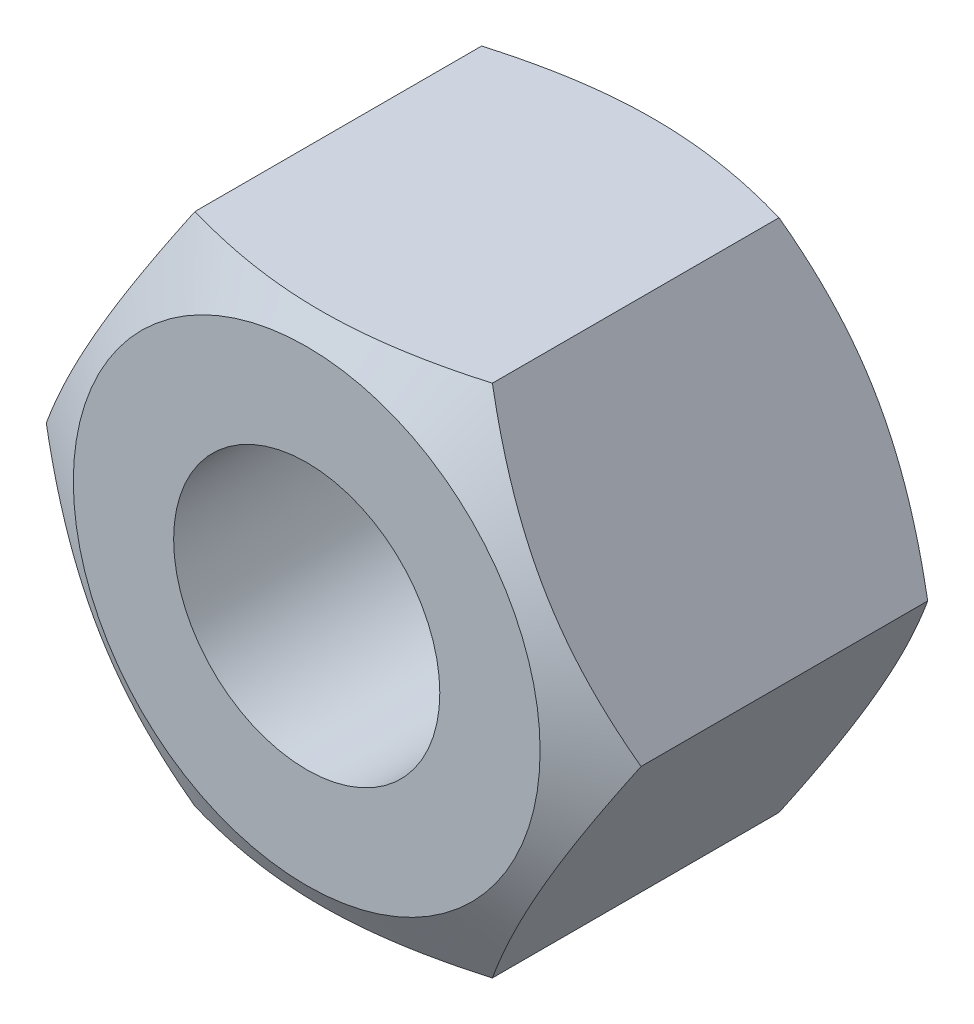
ISO-10303-21;
HEADER;
FILE_DESCRIPTION(('STEP AP214'),'2;1');
FILE_NAME('part.step','',(''),(''),'','','');
FILE_SCHEMA(('AUTOMOTIVE_DESIGN { 1 0 10303 214 1 1 1 1 }'));
ENDSEC;
DATA;
#1=APPLICATION_CONTEXT('core data for automotive mechanical design processes');
#2=APPLICATION_PROTOCOL_DEFINITION('international standard','automotive_design',2000,#1);
#3=PRODUCT_CONTEXT('',#1,'mechanical');
#4=PRODUCT('Part','Part','',(#3));
#5=PRODUCT_RELATED_PRODUCT_CATEGORY('part','',(#4));
#6=PRODUCT_DEFINITION_FORMATION('','',#4);
#7=PRODUCT_DEFINITION_CONTEXT('part definition',#1,'design');
#8=PRODUCT_DEFINITION('design','',#6,#7);
#9=PRODUCT_DEFINITION_SHAPE('','',#8);
#10=(LENGTH_UNIT() NAMED_UNIT(*) SI_UNIT(.MILLI.,.METRE.));
#11=(NAMED_UNIT(*) PLANE_ANGLE_UNIT() SI_UNIT($,.RADIAN.));
#12=(NAMED_UNIT(*) SI_UNIT($,.STERADIAN.) SOLID_ANGLE_UNIT());
#13=UNCERTAINTY_MEASURE_WITH_UNIT(LENGTH_MEASURE(1.E-05),#10,'distance_accuracy_value','');
#14=(GEOMETRIC_REPRESENTATION_CONTEXT(3) GLOBAL_UNCERTAINTY_ASSIGNED_CONTEXT((#13)) GLOBAL_UNIT_ASSIGNED_CONTEXT((#10,
#11,#12)) REPRESENTATION_CONTEXT('',''));
#15=CARTESIAN_POINT('',(0.,0.,0.));
#16=DIRECTION('',(0.,0.,1.));
#17=DIRECTION('',(1.,0.,0.));
#18=AXIS2_PLACEMENT_3D('',#15,#16,#17);
#19=CARTESIAN_POINT('',(-2.3094010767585,-3.99999999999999,-5.6));
#20=DIRECTION('',(0.,-1.,0.));
#21=DIRECTION('',(0.,0.,-1.));
#22=AXIS2_PLACEMENT_3D('',#19,#20,#21);
#23=PLANE('',#22);
#24=CARTESIAN_POINT('',(-6.09489331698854,-3.99999999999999,-2.11613226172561));
#25=CARTESIAN_POINT('',(-5.91950199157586,-3.99999999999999,-2.0314984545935));
#26=CARTESIAN_POINT('',(-5.74369257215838,-3.99999999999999,-1.94771521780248));
#27=CARTESIAN_POINT('',(-5.39101133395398,-3.99999999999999,-1.78233664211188));
#28=CARTESIAN_POINT('',(-5.2141393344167,-3.99999999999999,-1.70074168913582));
#29=CARTESIAN_POINT('',(-4.85813636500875,-3.99999999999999,-1.53979001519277));
#30=CARTESIAN_POINT('',(-4.67899824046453,-3.99999999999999,-1.46044906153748));
#31=CARTESIAN_POINT('',(-4.31923849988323,-3.99999999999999,-1.30521851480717));
#32=CARTESIAN_POINT('',(-4.13861696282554,-3.99999999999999,-1.229328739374));
#33=CARTESIAN_POINT('',(-3.7735011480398,-3.99999999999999,-1.08107583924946));
#34=CARTESIAN_POINT('',(-3.58898622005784,-3.99999999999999,-1.00876328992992));
#35=CARTESIAN_POINT('',(-3.21776937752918,-3.99999999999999,-0.869876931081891));
#36=CARTESIAN_POINT('',(-3.03106722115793,-3.99999999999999,-0.80330376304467));
#37=CARTESIAN_POINT('',(-2.65557248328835,-3.99999999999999,-0.677706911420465));
#38=CARTESIAN_POINT('',(-2.46678541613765,-3.99999999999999,-0.618666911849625));
#39=CARTESIAN_POINT('',(-2.08652902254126,-3.99999999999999,-0.510073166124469));
#40=CARTESIAN_POINT('',(-1.8950605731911,-3.99999999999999,-0.460516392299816));
#41=CARTESIAN_POINT('',(-1.50929874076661,-3.99999999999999,-0.37331108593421));
#42=CARTESIAN_POINT('',(-1.31500426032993,-3.99999999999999,-0.335667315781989));
#43=CARTESIAN_POINT('',(-0.924106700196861,-3.99999999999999,-0.274847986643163));
#44=CARTESIAN_POINT('',(-0.727503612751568,-3.99999999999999,-0.251672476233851));
#45=CARTESIAN_POINT('',(-0.334240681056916,-3.99999999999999,-0.221840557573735));
#46=CARTESIAN_POINT('',(-0.137588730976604,-3.99999999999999,-0.215082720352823));
#47=CARTESIAN_POINT('',(0.255527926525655,-3.99999999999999,-0.218431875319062));
#48=CARTESIAN_POINT('',(0.451992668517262,-3.99999999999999,-0.228534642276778));
#49=CARTESIAN_POINT('',(0.788354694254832,-3.99999999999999,-0.259560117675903));
#50=CARTESIAN_POINT('',(0.928625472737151,-3.99999999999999,-0.276641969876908));
#51=CARTESIAN_POINT('',(1.20806274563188,-3.99999999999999,-0.318274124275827));
#52=CARTESIAN_POINT('',(1.34722906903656,-3.99999999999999,-0.342825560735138));
#53=CARTESIAN_POINT('',(1.76329750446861,-3.99999999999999,-0.426460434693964));
#54=CARTESIAN_POINT('',(2.03822284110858,-3.99999999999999,-0.495467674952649));
#55=CARTESIAN_POINT('',(2.4494090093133,-3.99999999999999,-0.61419997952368));
#56=CARTESIAN_POINT('',(2.58782303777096,-3.99999999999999,-0.656885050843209));
#57=CARTESIAN_POINT('',(2.86331367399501,-3.99999999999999,-0.746448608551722));
#58=CARTESIAN_POINT('',(3.00039016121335,-3.99999999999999,-0.793327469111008));
#59=CARTESIAN_POINT('',(3.27252112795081,-3.99999999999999,-0.89027873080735));
#60=CARTESIAN_POINT('',(3.40758266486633,-3.99999999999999,-0.940331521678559));
#61=CARTESIAN_POINT('',(3.67656082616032,-3.99999999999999,-1.04329523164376));
#62=CARTESIAN_POINT('',(3.81047782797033,-3.99999999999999,-1.09620516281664));
#63=CARTESIAN_POINT('',(3.94391362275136,-3.99999999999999,-1.1502752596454));
#64=B_SPLINE_CURVE_WITH_KNOTS('',3,(#24,#25,#26,#27,#28,#29,#30,#31,#32,#33,#34,#35,#36,#37,#38,
#39,#40,#41,#42,#43,#44,#45,#46,#47,#48,#49,#50,#51,#52,#53,#54,#55,#56,#57,#58,#59,#60,#61,#62,
#63),.UNSPECIFIED.,.F.,.F.,(4,2,2,2,2,2,2,2,2,2,2,2,2,2,2,2,2,2,2,4),(0.,0.584238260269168,
1.16857888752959,1.75631615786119,2.34402233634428,2.93848518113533,3.5330143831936,
4.12623321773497,4.71926234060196,5.31252823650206,5.9057961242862,6.49538935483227,
7.08483485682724,7.50854871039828,7.9323269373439,8.78152355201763,9.21602908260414,
9.65057341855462,10.0826543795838,10.5145868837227),.UNSPECIFIED.);
#65=CARTESIAN_POINT('',(-2.30940107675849,-4.00000000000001,-0.573771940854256));
#66=VERTEX_POINT('',#65);
#67=CARTESIAN_POINT('',(2.30940107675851,-3.99999999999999,-0.573771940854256));
#68=VERTEX_POINT('',#67);
#69=EDGE_CURVE('E47',#66,#68,#64,.T.);
#70=ORIENTED_EDGE('',*,*,#69,.F.);
#71=DIRECTION('',(0.,0.,1.));
#72=VECTOR('',#71,1.);
#73=CARTESIAN_POINT('',(-2.3094010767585,-3.99999999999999,-5.6));
#74=LINE('',#73,#72);
#75=CARTESIAN_POINT('',(-2.30940107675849,-4.00000000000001,-5.02622805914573));
#76=VERTEX_POINT('',#75);
#77=EDGE_CURVE('E11',#76,#66,#74,.T.);
#78=ORIENTED_EDGE('',*,*,#77,.F.);
#79=CARTESIAN_POINT('',(-6.09489331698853,-3.99999999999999,-3.48386773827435));
#80=CARTESIAN_POINT('',(-5.91950199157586,-3.99999999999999,-3.56850154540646));
#81=CARTESIAN_POINT('',(-5.74369257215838,-3.99999999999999,-3.65228478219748));
#82=CARTESIAN_POINT('',(-5.39101133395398,-3.99999999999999,-3.81766335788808));
#83=CARTESIAN_POINT('',(-5.2141393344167,-3.99999999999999,-3.89925831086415));
#84=CARTESIAN_POINT('',(-4.85813636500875,-3.99999999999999,-4.0602099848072));
#85=CARTESIAN_POINT('',(-4.67899824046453,-3.99999999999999,-4.13955093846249));
#86=CARTESIAN_POINT('',(-4.31923849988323,-3.99999999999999,-4.2947814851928));
#87=CARTESIAN_POINT('',(-4.13861696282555,-3.99999999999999,-4.37067126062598));
#88=CARTESIAN_POINT('',(-3.7735011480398,-3.99999999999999,-4.51892416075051));
#89=CARTESIAN_POINT('',(-3.58898622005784,-3.99999999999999,-4.59123671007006));
#90=CARTESIAN_POINT('',(-3.21776937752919,-3.99999999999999,-4.73012306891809));
#91=CARTESIAN_POINT('',(-3.03106722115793,-3.99999999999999,-4.79669623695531));
#92=CARTESIAN_POINT('',(-2.65557248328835,-3.99999999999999,-4.92229308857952));
#93=CARTESIAN_POINT('',(-2.46678541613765,-3.99999999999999,-4.98133308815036));
#94=CARTESIAN_POINT('',(-2.08652902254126,-3.99999999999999,-5.08992683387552));
#95=CARTESIAN_POINT('',(-1.8950605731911,-3.99999999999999,-5.13948360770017));
#96=CARTESIAN_POINT('',(-1.50929874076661,-3.99999999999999,-5.22668891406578));
#97=CARTESIAN_POINT('',(-1.31500426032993,-3.99999999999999,-5.26433268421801));
#98=CARTESIAN_POINT('',(-0.924106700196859,-3.99999999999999,-5.32515201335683));
#99=CARTESIAN_POINT('',(-0.727503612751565,-3.99999999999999,-5.34832752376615));
#100=CARTESIAN_POINT('',(-0.334240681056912,-3.99999999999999,-5.37815944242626));
#101=CARTESIAN_POINT('',(-0.137588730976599,-3.99999999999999,-5.38491727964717));
#102=CARTESIAN_POINT('',(0.255527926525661,-3.99999999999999,-5.38156812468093));
#103=CARTESIAN_POINT('',(0.451992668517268,-3.99999999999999,-5.37146535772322));
#104=CARTESIAN_POINT('',(0.788354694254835,-3.99999999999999,-5.34043988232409));
#105=CARTESIAN_POINT('',(0.92862547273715,-3.99999999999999,-5.32335803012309));
#106=CARTESIAN_POINT('',(1.20806274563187,-3.99999999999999,-5.28172587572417));
#107=CARTESIAN_POINT('',(1.34722906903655,-3.99999999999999,-5.25717443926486));
#108=CARTESIAN_POINT('',(1.76329750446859,-3.99999999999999,-5.17353956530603));
#109=CARTESIAN_POINT('',(2.03822284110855,-3.99999999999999,-5.10453232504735));
#110=CARTESIAN_POINT('',(2.44940900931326,-3.99999999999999,-4.98580002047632));
#111=CARTESIAN_POINT('',(2.58782303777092,-3.99999999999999,-4.94311494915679));
#112=CARTESIAN_POINT('',(2.86331367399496,-3.99999999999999,-4.85355139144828));
#113=CARTESIAN_POINT('',(3.0003901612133,-3.99999999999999,-4.80667253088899));
#114=CARTESIAN_POINT('',(3.27252112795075,-3.99999999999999,-4.70972126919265));
#115=CARTESIAN_POINT('',(3.40758266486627,-3.99999999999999,-4.65966847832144));
#116=CARTESIAN_POINT('',(3.67656082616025,-3.99999999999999,-4.55670476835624));
#117=CARTESIAN_POINT('',(3.81047782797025,-3.99999999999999,-4.50379483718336));
#118=CARTESIAN_POINT('',(3.94391362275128,-3.99999999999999,-4.4497247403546));
#119=B_SPLINE_CURVE_WITH_KNOTS('',3,(#79,#80,#81,#82,#83,#84,#85,#86,#87,#88,#89,#90,#91,#92,
#93,#94,#95,#96,#97,#98,#99,#100,#101,#102,#103,#104,#105,#106,#107,#108,#109,#110,#111,#112,
#113,#114,#115,#116,#117,#118),.UNSPECIFIED.,.F.,.F.,(4,2,2,2,2,2,2,2,2,2,2,2,2,2,2,2,2,2,2,4),
(0.,0.584238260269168,1.16857888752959,1.7563161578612,2.34402233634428,2.93848518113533,
3.53301438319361,4.12623321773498,4.71926234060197,5.31252823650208,5.90579612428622,
6.49538935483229,7.08483485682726,7.50854871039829,7.9323269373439,8.78152355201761,
9.21602908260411,9.65057341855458,10.0826543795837,10.5145868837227),.UNSPECIFIED.);
#120=CARTESIAN_POINT('',(2.3094010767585,-4.,-5.02622805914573));
#121=VERTEX_POINT('',#120);
#122=EDGE_CURVE('E126',#121,#76,#119,.F.);
#123=ORIENTED_EDGE('',*,*,#122,.F.);
#124=DIRECTION('',(0.,0.,1.));
#125=VECTOR('',#124,1.);
#126=CARTESIAN_POINT('',(2.30940107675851,-3.99999999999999,-5.6));
#127=LINE('',#126,#125);
#128=EDGE_CURVE('E34',#121,#68,#127,.T.);
#129=ORIENTED_EDGE('',*,*,#128,.T.);
#130=EDGE_LOOP('',(#70,#78,#123,#129));
#131=FACE_BOUND('',#130,.T.);
#132=ADVANCED_FACE('F30',(#131),#23,.T.);
#133=CARTESIAN_POINT('',(-4.61880215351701,0.,-5.6));
#134=DIRECTION('',(-0.866025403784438,-0.500000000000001,0.));
#135=DIRECTION('',(0.500000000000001,-0.866025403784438,0.));
#136=AXIS2_PLACEMENT_3D('',#133,#134,#135);
#137=PLANE('',#136);
#138=CARTESIAN_POINT('',(-4.61891762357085,0.000200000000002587,-0.573838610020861));
#139=CARTESIAN_POINT('',(-4.51743148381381,-0.175579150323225,-0.515224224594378));
#140=CARTESIAN_POINT('',(-4.41506932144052,-0.352875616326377,-0.461916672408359));
#141=CARTESIAN_POINT('',(-4.2085725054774,-0.710538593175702,-0.368868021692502));
#142=CARTESIAN_POINT('',(-4.10443418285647,-0.890911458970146,-0.329159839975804));
#143=CARTESIAN_POINT('',(-3.89744813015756,-1.24942181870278,-0.26734856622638));
#144=CARTESIAN_POINT('',(-3.7946322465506,-1.42750415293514,-0.24483408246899));
#145=CARTESIAN_POINT('',(-3.58851671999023,-1.7845067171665,-0.217956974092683));
#146=CARTESIAN_POINT('',(-3.48521782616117,-1.96342564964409,-0.213572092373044));
#147=CARTESIAN_POINT('',(-3.29219970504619,-2.29774284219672,-0.22269642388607));
#148=CARTESIAN_POINT('',(-3.20245157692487,-2.45319115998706,-0.233965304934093));
#149=CARTESIAN_POINT('',(-3.02354002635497,-2.76307505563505,-0.26968034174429));
#150=CARTESIAN_POINT('',(-2.93437722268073,-2.91750956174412,-0.294138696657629));
#151=CARTESIAN_POINT('',(-2.75509682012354,-3.22803232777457,-0.355282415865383));
#152=CARTESIAN_POINT('',(-2.6650019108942,-3.38408128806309,-0.392226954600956));
#153=CARTESIAN_POINT('',(-2.48615580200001,-3.69385183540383,-0.476076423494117));
#154=CARTESIAN_POINT('',(-2.39740231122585,-3.84757739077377,-0.522961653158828));
#155=CARTESIAN_POINT('',(-2.30928560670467,-4.00019999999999,-0.573838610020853));
#156=B_SPLINE_CURVE_WITH_KNOTS('',3,(#138,#139,#140,#141,#142,#143,#144,#145,#146,#147,#148,
#149,#150,#151,#152,#153,#154,#155),.UNSPECIFIED.,.F.,.F.,(4,2,2,2,2,2,2,2,4),(0.,
0.634047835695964,1.26961969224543,1.88946157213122,2.50854226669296,3.04757825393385,
3.58711366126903,4.13861653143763,4.68903648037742),.UNSPECIFIED.);
#157=CARTESIAN_POINT('',(-4.61880215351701,0.,-0.573771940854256));
#158=VERTEX_POINT('',#157);
#159=EDGE_CURVE('E87',#158,#66,#156,.T.);
#160=ORIENTED_EDGE('',*,*,#159,.F.);
#161=DIRECTION('',(0.,0.,1.));
#162=VECTOR('',#161,1.);
#163=CARTESIAN_POINT('',(-4.61880215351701,0.,-5.6));
#164=LINE('',#163,#162);
#165=CARTESIAN_POINT('',(-4.61880215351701,0.,-5.02622805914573));
#166=VERTEX_POINT('',#165);
#167=EDGE_CURVE('E39',#166,#158,#164,.T.);
#168=ORIENTED_EDGE('',*,*,#167,.F.);
#169=CARTESIAN_POINT('',(-2.30928560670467,-4.00019999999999,-5.02616138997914));
#170=CARTESIAN_POINT('',(-2.41077174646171,-3.82442084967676,-5.08477577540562));
#171=CARTESIAN_POINT('',(-2.513133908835,-3.64712438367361,-5.13808332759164));
#172=CARTESIAN_POINT('',(-2.71963072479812,-3.28946140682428,-5.2311319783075));
#173=CARTESIAN_POINT('',(-2.82376904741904,-3.10908854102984,-5.2708401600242));
#174=CARTESIAN_POINT('',(-3.03075510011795,-2.7505781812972,-5.33265143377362));
#175=CARTESIAN_POINT('',(-3.13357098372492,-2.57249584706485,-5.35516591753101));
#176=CARTESIAN_POINT('',(-3.33968651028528,-2.21549328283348,-5.38204302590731));
#177=CARTESIAN_POINT('',(-3.44298540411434,-2.03657435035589,-5.38642790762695));
#178=CARTESIAN_POINT('',(-3.63600352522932,-1.70225715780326,-5.37730357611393));
#179=CARTESIAN_POINT('',(-3.72575165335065,-1.54680884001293,-5.3660346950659));
#180=CARTESIAN_POINT('',(-3.90466320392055,-1.23692494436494,-5.3303196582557));
#181=CARTESIAN_POINT('',(-3.99382600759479,-1.08249043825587,-5.30586130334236));
#182=CARTESIAN_POINT('',(-4.17310641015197,-0.771967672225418,-5.24471758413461));
#183=CARTESIAN_POINT('',(-4.26320131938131,-0.615918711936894,-5.20777304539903));
#184=CARTESIAN_POINT('',(-4.44204742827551,-0.306148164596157,-5.12392357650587));
#185=CARTESIAN_POINT('',(-4.53080091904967,-0.152422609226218,-5.07703834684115));
#186=CARTESIAN_POINT('',(-4.61891762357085,0.000200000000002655,-5.02616138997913));
#187=B_SPLINE_CURVE_WITH_KNOTS('',3,(#169,#170,#171,#172,#173,#174,#175,#176,#177,#178,#179,
#180,#181,#182,#183,#184,#185,#186),.UNSPECIFIED.,.F.,.F.,(4,2,2,2,2,2,2,2,4),(0.,
0.634047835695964,1.26961969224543,1.88946157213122,2.50854226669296,3.04757825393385,
3.58711366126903,4.13861653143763,4.68903648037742),.UNSPECIFIED.);
#188=EDGE_CURVE('E133',#76,#166,#187,.T.);
#189=ORIENTED_EDGE('',*,*,#188,.F.);
#190=ORIENTED_EDGE('',*,*,#77,.T.);
#191=EDGE_LOOP('',(#160,#168,#189,#190));
#192=FACE_BOUND('',#191,.T.);
#193=ADVANCED_FACE('F97',(#192),#137,.T.);
#194=CARTESIAN_POINT('',(-2.3094010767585,4.,-5.6));
#195=DIRECTION('',(-0.866025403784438,0.5,0.));
#196=DIRECTION('',(-0.5,-0.866025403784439,0.));
#197=AXIS2_PLACEMENT_3D('',#194,#195,#196);
#198=PLANE('',#197);
#199=CARTESIAN_POINT('',(-2.30928560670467,4.0002,-0.573838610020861));
#200=CARTESIAN_POINT('',(-2.41077174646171,3.82442084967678,-0.515224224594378));
#201=CARTESIAN_POINT('',(-2.513133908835,3.64712438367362,-0.46191667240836));
#202=CARTESIAN_POINT('',(-2.71963072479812,3.2894614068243,-0.368868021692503));
#203=CARTESIAN_POINT('',(-2.82376904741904,3.10908854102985,-0.329159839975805));
#204=CARTESIAN_POINT('',(-3.03075510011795,2.75057818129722,-0.267348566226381));
#205=CARTESIAN_POINT('',(-3.13357098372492,2.57249584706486,-0.244834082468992));
#206=CARTESIAN_POINT('',(-3.33968651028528,2.2154932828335,-0.217956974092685));
#207=CARTESIAN_POINT('',(-3.44298540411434,2.03657435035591,-0.213572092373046));
#208=CARTESIAN_POINT('',(-3.63600352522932,1.70225715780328,-0.222696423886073));
#209=CARTESIAN_POINT('',(-3.72575165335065,1.54680884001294,-0.233965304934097));
#210=CARTESIAN_POINT('',(-3.90466320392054,1.23692494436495,-0.269680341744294));
#211=CARTESIAN_POINT('',(-3.99382600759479,1.08249043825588,-0.294138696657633));
#212=CARTESIAN_POINT('',(-4.17310641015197,0.771967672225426,-0.355282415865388));
#213=CARTESIAN_POINT('',(-4.26320131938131,0.615918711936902,-0.392226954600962));
#214=CARTESIAN_POINT('',(-4.44204742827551,0.306148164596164,-0.476076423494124));
#215=CARTESIAN_POINT('',(-4.53080091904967,0.152422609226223,-0.522961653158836));
#216=CARTESIAN_POINT('',(-4.61891762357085,-0.00019999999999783,-0.573838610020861));
#217=B_SPLINE_CURVE_WITH_KNOTS('',3,(#199,#200,#201,#202,#203,#204,#205,#206,#207,#208,#209,
#210,#211,#212,#213,#214,#215,#216),.UNSPECIFIED.,.F.,.F.,(4,2,2,2,2,2,2,2,4),(0.,
0.634047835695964,1.26961969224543,1.88946157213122,2.50854226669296,3.04757825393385,
3.58711366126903,4.13861653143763,4.68903648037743),.UNSPECIFIED.);
#218=CARTESIAN_POINT('',(-2.3094010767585,4.,-0.573771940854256));
#219=VERTEX_POINT('',#218);
#220=EDGE_CURVE('E83',#219,#158,#217,.T.);
#221=ORIENTED_EDGE('',*,*,#220,.F.);
#222=DIRECTION('',(0.,0.,1.));
#223=VECTOR('',#222,1.);
#224=CARTESIAN_POINT('',(-2.3094010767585,4.,-5.6));
#225=LINE('',#224,#223);
#226=CARTESIAN_POINT('',(-2.3094010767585,4.,-5.02622805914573));
#227=VERTEX_POINT('',#226);
#228=EDGE_CURVE('E104',#227,#219,#225,.T.);
#229=ORIENTED_EDGE('',*,*,#228,.F.);
#230=CARTESIAN_POINT('',(-4.61891762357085,-0.000199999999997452,-5.02616138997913));
#231=CARTESIAN_POINT('',(-4.51743148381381,0.175579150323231,-5.08477577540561));
#232=CARTESIAN_POINT('',(-4.41506932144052,0.352875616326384,-5.13808332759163));
#233=CARTESIAN_POINT('',(-4.2085725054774,0.710538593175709,-5.23113197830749));
#234=CARTESIAN_POINT('',(-4.10443418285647,0.890911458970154,-5.27084016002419));
#235=CARTESIAN_POINT('',(-3.89744813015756,1.24942181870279,-5.33265143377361));
#236=CARTESIAN_POINT('',(-3.7946322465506,1.42750415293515,-5.355165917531));
#237=CARTESIAN_POINT('',(-3.58851671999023,1.78450671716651,-5.38204302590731));
#238=CARTESIAN_POINT('',(-3.48521782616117,1.9634256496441,-5.38642790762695));
#239=CARTESIAN_POINT('',(-3.29219970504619,2.29774284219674,-5.37730357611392));
#240=CARTESIAN_POINT('',(-3.20245157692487,2.45319115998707,-5.3660346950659));
#241=CARTESIAN_POINT('',(-3.02354002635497,2.76307505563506,-5.3303196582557));
#242=CARTESIAN_POINT('',(-2.93437722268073,2.91750956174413,-5.30586130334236));
#243=CARTESIAN_POINT('',(-2.75509682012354,3.22803232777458,-5.2447175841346));
#244=CARTESIAN_POINT('',(-2.6650019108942,3.38408128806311,-5.20777304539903));
#245=CARTESIAN_POINT('',(-2.48615580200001,3.69385183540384,-5.12392357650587));
#246=CARTESIAN_POINT('',(-2.39740231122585,3.84757739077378,-5.07703834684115));
#247=CARTESIAN_POINT('',(-2.30928560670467,4.0002,-5.02616138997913));
#248=B_SPLINE_CURVE_WITH_KNOTS('',3,(#230,#231,#232,#233,#234,#235,#236,#237,#238,#239,#240,
#241,#242,#243,#244,#245,#246,#247),.UNSPECIFIED.,.F.,.F.,(4,2,2,2,2,2,2,2,4),(0.,
0.634047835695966,1.26961969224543,1.88946157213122,2.50854226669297,3.04757825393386,
3.58711366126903,4.13861653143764,4.68903648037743),.UNSPECIFIED.);
#249=EDGE_CURVE('E103',#166,#227,#248,.T.);
#250=ORIENTED_EDGE('',*,*,#249,.F.);
#251=ORIENTED_EDGE('',*,*,#167,.T.);
#252=EDGE_LOOP('',(#221,#229,#250,#251));
#253=FACE_BOUND('',#252,.T.);
#254=ADVANCED_FACE('F102',(#253),#198,.T.);
#255=CARTESIAN_POINT('',(2.30940107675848,4.,-5.6));
#256=DIRECTION('',(0.,1.,0.));
#257=DIRECTION('',(0.,0.,1.));
#258=AXIS2_PLACEMENT_3D('',#255,#256,#257);
#259=PLANE('',#258);
#260=CARTESIAN_POINT('',(-6.09489331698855,4.,-2.11613226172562));
#261=CARTESIAN_POINT('',(-5.91950199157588,4.,-2.03149845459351));
#262=CARTESIAN_POINT('',(-5.74369257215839,4.,-1.94771521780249));
#263=CARTESIAN_POINT('',(-5.39101133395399,4.,-1.7823366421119));
#264=CARTESIAN_POINT('',(-5.21413933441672,4.,-1.70074168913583));
#265=CARTESIAN_POINT('',(-4.85813636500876,4.,-1.53979001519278));
#266=CARTESIAN_POINT('',(-4.67899824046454,4.,-1.46044906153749));
#267=CARTESIAN_POINT('',(-4.31923849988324,4.,-1.30521851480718));
#268=CARTESIAN_POINT('',(-4.13861696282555,4.,-1.22932873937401));
#269=CARTESIAN_POINT('',(-3.77350114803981,4.,-1.08107583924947));
#270=CARTESIAN_POINT('',(-3.58898622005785,4.,-1.00876328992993));
#271=CARTESIAN_POINT('',(-3.21776937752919,4.,-0.8698769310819));
#272=CARTESIAN_POINT('',(-3.03106722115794,4.,-0.803303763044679));
#273=CARTESIAN_POINT('',(-2.65557248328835,4.,-0.677706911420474));
#274=CARTESIAN_POINT('',(-2.46678541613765,4.,-0.618666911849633));
#275=CARTESIAN_POINT('',(-2.08652902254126,4.,-0.510073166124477));
#276=CARTESIAN_POINT('',(-1.8950605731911,4.,-0.460516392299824));
#277=CARTESIAN_POINT('',(-1.50929874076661,4.,-0.373311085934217));
#278=CARTESIAN_POINT('',(-1.31500426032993,4.,-0.335667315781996));
#279=CARTESIAN_POINT('',(-0.92410670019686,4.,-0.274847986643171));
#280=CARTESIAN_POINT('',(-0.727503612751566,4.,-0.251672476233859));
#281=CARTESIAN_POINT('',(-0.334240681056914,4.,-0.221840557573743));
#282=CARTESIAN_POINT('',(-0.137588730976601,4.,-0.215082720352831));
#283=CARTESIAN_POINT('',(0.255527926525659,4.,-0.21843187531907));
#284=CARTESIAN_POINT('',(0.451992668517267,4.,-0.228534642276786));
#285=CARTESIAN_POINT('',(0.788354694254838,4.,-0.259560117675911));
#286=CARTESIAN_POINT('',(0.928625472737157,4.,-0.276641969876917));
#287=CARTESIAN_POINT('',(1.20806274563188,4.,-0.318274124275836));
#288=CARTESIAN_POINT('',(1.34722906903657,4.,-0.342825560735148));
#289=CARTESIAN_POINT('',(1.76329750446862,4.,-0.426460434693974));
#290=CARTESIAN_POINT('',(2.03822284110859,4.,-0.495467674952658));
#291=CARTESIAN_POINT('',(2.44940900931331,4.,-0.61419997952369));
#292=CARTESIAN_POINT('',(2.58782303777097,4.,-0.656885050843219));
#293=CARTESIAN_POINT('',(2.86331367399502,4.,-0.746448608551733));
#294=CARTESIAN_POINT('',(3.00039016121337,4.,-0.79332746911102));
#295=CARTESIAN_POINT('',(3.27252112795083,4.,-0.890278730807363));
#296=CARTESIAN_POINT('',(3.40758266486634,4.,-0.940331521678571));
#297=CARTESIAN_POINT('',(3.67656082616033,4.,-1.04329523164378));
#298=CARTESIAN_POINT('',(3.81047782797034,4.,-1.09620516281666));
#299=CARTESIAN_POINT('',(3.94391362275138,4.,-1.15027525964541));
#300=B_SPLINE_CURVE_WITH_KNOTS('',3,(#260,#261,#262,#263,#264,#265,#266,#267,#268,#269,#270,
#271,#272,#273,#274,#275,#276,#277,#278,#279,#280,#281,#282,#283,#284,#285,#286,#287,#288,#289,
#290,#291,#292,#293,#294,#295,#296,#297,#298,#299),.UNSPECIFIED.,.F.,.F.,(4,2,2,2,2,2,2,2,2,2,2,
2,2,2,2,2,2,2,2,4),(0.,0.584238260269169,1.1685788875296,1.7563161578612,2.34402233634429,
2.93848518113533,3.53301438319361,4.12623321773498,4.71926234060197,5.31252823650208,
5.90579612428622,6.4953893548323,7.08483485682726,7.5085487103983,7.93232693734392,
8.78152355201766,9.21602908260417,9.65057341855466,10.0826543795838,10.5145868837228),.UNSPECIFIED.);
#301=CARTESIAN_POINT('',(2.30940107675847,4.00000000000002,-0.573771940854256));
#302=VERTEX_POINT('',#301);
#303=EDGE_CURVE('E89',#302,#219,#300,.F.);
#304=ORIENTED_EDGE('',*,*,#303,.F.);
#305=DIRECTION('',(0.,0.,1.));
#306=VECTOR('',#305,1.);
#307=CARTESIAN_POINT('',(2.30940107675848,4.,-5.6));
#308=LINE('',#307,#306);
#309=CARTESIAN_POINT('',(2.30940107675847,4.00000000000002,-5.02622805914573));
#310=VERTEX_POINT('',#309);
#311=EDGE_CURVE('E106',#310,#302,#308,.T.);
#312=ORIENTED_EDGE('',*,*,#311,.F.);
#313=CARTESIAN_POINT('',(-6.09489331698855,4.,-3.48386773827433));
#314=CARTESIAN_POINT('',(-5.91950199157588,4.,-3.56850154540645));
#315=CARTESIAN_POINT('',(-5.74369257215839,4.,-3.65228478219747));
#316=CARTESIAN_POINT('',(-5.39101133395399,4.,-3.81766335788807));
#317=CARTESIAN_POINT('',(-5.21413933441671,4.,-3.89925831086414));
#318=CARTESIAN_POINT('',(-4.85813636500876,4.,-4.06020998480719));
#319=CARTESIAN_POINT('',(-4.67899824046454,4.,-4.13955093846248));
#320=CARTESIAN_POINT('',(-4.31923849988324,4.,-4.29478148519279));
#321=CARTESIAN_POINT('',(-4.13861696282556,4.,-4.37067126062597));
#322=CARTESIAN_POINT('',(-3.77350114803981,4.,-4.5189241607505));
#323=CARTESIAN_POINT('',(-3.58898622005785,4.,-4.59123671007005));
#324=CARTESIAN_POINT('',(-3.21776937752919,4.,-4.73012306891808));
#325=CARTESIAN_POINT('',(-3.03106722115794,4.,-4.79669623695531));
#326=CARTESIAN_POINT('',(-2.65557248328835,4.,-4.92229308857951));
#327=CARTESIAN_POINT('',(-2.46678541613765,4.,-4.98133308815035));
#328=CARTESIAN_POINT('',(-2.08652902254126,4.,-5.08992683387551));
#329=CARTESIAN_POINT('',(-1.8950605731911,4.,-5.13948360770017));
#330=CARTESIAN_POINT('',(-1.50929874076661,4.,-5.22668891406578));
#331=CARTESIAN_POINT('',(-1.31500426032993,4.,-5.264332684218));
#332=CARTESIAN_POINT('',(-0.924106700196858,4.,-5.32515201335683));
#333=CARTESIAN_POINT('',(-0.727503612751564,4.,-5.34832752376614));
#334=CARTESIAN_POINT('',(-0.334240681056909,4.,-5.37815944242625));
#335=CARTESIAN_POINT('',(-0.137588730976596,4.,-5.38491727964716));
#336=CARTESIAN_POINT('',(0.255527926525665,4.,-5.38156812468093));
#337=CARTESIAN_POINT('',(0.451992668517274,4.,-5.37146535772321));
#338=CARTESIAN_POINT('',(0.788354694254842,4.,-5.34043988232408));
#339=CARTESIAN_POINT('',(0.928625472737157,4.,-5.32335803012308));
#340=CARTESIAN_POINT('',(1.20806274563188,4.,-5.28172587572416));
#341=CARTESIAN_POINT('',(1.34722906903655,4.,-5.25717443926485));
#342=CARTESIAN_POINT('',(1.7632975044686,4.,-5.17353956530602));
#343=CARTESIAN_POINT('',(2.03822284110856,4.,-5.10453232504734));
#344=CARTESIAN_POINT('',(2.44940900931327,4.,-4.98580002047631));
#345=CARTESIAN_POINT('',(2.58782303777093,4.,-4.94311494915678));
#346=CARTESIAN_POINT('',(2.86331367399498,4.,-4.85355139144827));
#347=CARTESIAN_POINT('',(3.00039016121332,4.,-4.80667253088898));
#348=CARTESIAN_POINT('',(3.27252112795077,4.,-4.70972126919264));
#349=CARTESIAN_POINT('',(3.40758266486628,4.,-4.65966847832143));
#350=CARTESIAN_POINT('',(3.67656082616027,4.,-4.55670476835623));
#351=CARTESIAN_POINT('',(3.81047782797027,4.,-4.50379483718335));
#352=CARTESIAN_POINT('',(3.9439136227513,4.,-4.44972474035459));
#353=B_SPLINE_CURVE_WITH_KNOTS('',3,(#313,#314,#315,#316,#317,#318,#319,#320,#321,#322,#323,
#324,#325,#326,#327,#328,#329,#330,#331,#332,#333,#334,#335,#336,#337,#338,#339,#340,#341,#342,
#343,#344,#345,#346,#347,#348,#349,#350,#351,#352),.UNSPECIFIED.,.F.,.F.,(4,2,2,2,2,2,2,2,2,2,2,
2,2,2,2,2,2,2,2,4),(0.,0.58423826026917,1.1685788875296,1.7563161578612,2.34402233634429,
2.93848518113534,3.53301438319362,4.12623321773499,4.71926234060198,5.3125282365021,
5.90579612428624,6.49538935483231,7.08483485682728,7.50854871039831,7.93232693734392,
8.78152355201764,9.21602908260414,9.65057341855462,10.0826543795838,10.5145868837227),.UNSPECIFIED.);
#354=EDGE_CURVE('E164',#227,#310,#353,.T.);
#355=ORIENTED_EDGE('',*,*,#354,.F.);
#356=ORIENTED_EDGE('',*,*,#228,.T.);
#357=EDGE_LOOP('',(#304,#312,#355,#356));
#358=FACE_BOUND('',#357,.T.);
#359=ADVANCED_FACE('F175',(#358),#259,.T.);
#360=CARTESIAN_POINT('',(4.618802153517,0.,-5.6));
#361=DIRECTION('',(0.866025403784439,0.499999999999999,0.));
#362=DIRECTION('',(-0.499999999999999,0.866025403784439,0.));
#363=AXIS2_PLACEMENT_3D('',#360,#361,#362);
#364=PLANE('',#363);
#365=CARTESIAN_POINT('',(4.61891762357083,-0.000200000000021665,-0.573838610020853));
#366=CARTESIAN_POINT('',(4.5174314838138,0.175579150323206,-0.51522422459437));
#367=CARTESIAN_POINT('',(4.41506932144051,0.352875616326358,-0.461916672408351));
#368=CARTESIAN_POINT('',(4.20857250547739,0.710538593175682,-0.368868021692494));
#369=CARTESIAN_POINT('',(4.10443418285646,0.890911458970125,-0.329159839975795));
#370=CARTESIAN_POINT('',(3.89744813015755,1.24942181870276,-0.267348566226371));
#371=CARTESIAN_POINT('',(3.79463224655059,1.42750415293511,-0.244834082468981));
#372=CARTESIAN_POINT('',(3.58851671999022,1.78450671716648,-0.217956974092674));
#373=CARTESIAN_POINT('',(3.48521782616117,1.96342564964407,-0.213572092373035));
#374=CARTESIAN_POINT('',(3.29219970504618,2.2977428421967,-0.22269642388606));
#375=CARTESIAN_POINT('',(3.20245157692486,2.45319115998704,-0.233965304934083));
#376=CARTESIAN_POINT('',(3.02354002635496,2.76307505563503,-0.269680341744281));
#377=CARTESIAN_POINT('',(2.93437722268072,2.91750956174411,-0.294138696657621));
#378=CARTESIAN_POINT('',(2.75509682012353,3.22803232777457,-0.355282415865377));
#379=CARTESIAN_POINT('',(2.66500191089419,3.38408128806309,-0.392226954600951));
#380=CARTESIAN_POINT('',(2.48615580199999,3.69385183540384,-0.476076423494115));
#381=CARTESIAN_POINT('',(2.39740231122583,3.84757739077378,-0.522961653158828));
#382=CARTESIAN_POINT('',(2.30928560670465,4.0002,-0.573838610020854));
#383=B_SPLINE_CURVE_WITH_KNOTS('',3,(#365,#366,#367,#368,#369,#370,#371,#372,#373,#374,#375,
#376,#377,#378,#379,#380,#381,#382),.UNSPECIFIED.,.F.,.F.,(4,2,2,2,2,2,2,2,4),(0.,
0.634047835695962,1.26961969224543,1.88946157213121,2.50854226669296,3.04757825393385,
3.58711366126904,4.13861653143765,4.68903648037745),.UNSPECIFIED.);
#384=CARTESIAN_POINT('',(4.61880215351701,0.,-0.573771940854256));
#385=VERTEX_POINT('',#384);
#386=EDGE_CURVE('E206',#385,#302,#383,.T.);
#387=ORIENTED_EDGE('',*,*,#386,.F.);
#388=DIRECTION('',(0.,0.,1.));
#389=VECTOR('',#388,1.);
#390=CARTESIAN_POINT('',(4.618802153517,0.,-5.6));
#391=LINE('',#390,#389);
#392=CARTESIAN_POINT('',(4.618802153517,0.,-5.02622805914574));
#393=VERTEX_POINT('',#392);
#394=EDGE_CURVE('E111',#393,#385,#391,.T.);
#395=ORIENTED_EDGE('',*,*,#394,.F.);
#396=CARTESIAN_POINT('',(2.30928560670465,4.0002,-5.02616138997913));
#397=CARTESIAN_POINT('',(2.41077174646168,3.82442084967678,-5.08477577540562));
#398=CARTESIAN_POINT('',(2.51313390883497,3.64712438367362,-5.13808332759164));
#399=CARTESIAN_POINT('',(2.71963072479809,3.2894614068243,-5.2311319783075));
#400=CARTESIAN_POINT('',(2.82376904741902,3.10908854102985,-5.2708401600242));
#401=CARTESIAN_POINT('',(3.03075510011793,2.75057818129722,-5.33265143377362));
#402=CARTESIAN_POINT('',(3.13357098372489,2.57249584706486,-5.35516591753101));
#403=CARTESIAN_POINT('',(3.33968651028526,2.2154932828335,-5.38204302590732));
#404=CARTESIAN_POINT('',(3.44298540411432,2.03657435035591,-5.38642790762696));
#405=CARTESIAN_POINT('',(3.6360035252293,1.70225715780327,-5.37730357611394));
#406=CARTESIAN_POINT('',(3.72575165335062,1.54680884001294,-5.36603469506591));
#407=CARTESIAN_POINT('',(3.90466320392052,1.23692494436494,-5.33031965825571));
#408=CARTESIAN_POINT('',(3.99382600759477,1.08249043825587,-5.30586130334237));
#409=CARTESIAN_POINT('',(4.17310641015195,0.771967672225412,-5.24471758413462));
#410=CARTESIAN_POINT('',(4.2632013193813,0.615918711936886,-5.20777304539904));
#411=CARTESIAN_POINT('',(4.44204742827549,0.306148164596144,-5.12392357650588));
#412=CARTESIAN_POINT('',(4.53080091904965,0.152422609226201,-5.07703834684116));
#413=CARTESIAN_POINT('',(4.61891762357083,-0.000200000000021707,-5.02616138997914));
#414=B_SPLINE_CURVE_WITH_KNOTS('',3,(#396,#397,#398,#399,#400,#401,#402,#403,#404,#405,#406,
#407,#408,#409,#410,#411,#412,#413),.UNSPECIFIED.,.F.,.F.,(4,2,2,2,2,2,2,2,4),(0.,
0.634047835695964,1.26961969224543,1.88946157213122,2.50854226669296,3.04757825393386,
3.58711366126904,4.13861653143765,4.68903648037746),.UNSPECIFIED.);
#415=EDGE_CURVE('E55',#310,#393,#414,.T.);
#416=ORIENTED_EDGE('',*,*,#415,.F.);
#417=ORIENTED_EDGE('',*,*,#311,.T.);
#418=EDGE_LOOP('',(#387,#395,#416,#417));
#419=FACE_BOUND('',#418,.T.);
#420=ADVANCED_FACE('F205',(#419),#364,.T.);
#421=CARTESIAN_POINT('',(2.30940107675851,-3.99999999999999,-5.6));
#422=DIRECTION('',(0.866025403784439,-0.5,0.));
#423=DIRECTION('',(0.5,0.866025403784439,0.));
#424=AXIS2_PLACEMENT_3D('',#421,#422,#423);
#425=PLANE('',#424);
#426=CARTESIAN_POINT('',(2.30928560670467,-4.00019999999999,-0.573838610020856));
#427=CARTESIAN_POINT('',(2.41077174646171,-3.82442084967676,-0.515224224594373));
#428=CARTESIAN_POINT('',(2.513133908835,-3.64712438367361,-0.461916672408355));
#429=CARTESIAN_POINT('',(2.71963072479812,-3.28946140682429,-0.3688680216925));
#430=CARTESIAN_POINT('',(2.82376904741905,-3.10908854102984,-0.329159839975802));
#431=CARTESIAN_POINT('',(3.03075510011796,-2.7505781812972,-0.267348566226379));
#432=CARTESIAN_POINT('',(3.13357098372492,-2.57249584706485,-0.24483408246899));
#433=CARTESIAN_POINT('',(3.33968651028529,-2.21549328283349,-0.217956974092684));
#434=CARTESIAN_POINT('',(3.44298540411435,-2.0365743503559,-0.213572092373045));
#435=CARTESIAN_POINT('',(3.63600352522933,-1.70225715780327,-0.222696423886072));
#436=CARTESIAN_POINT('',(3.72575165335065,-1.54680884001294,-0.233965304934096));
#437=CARTESIAN_POINT('',(3.90466320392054,-1.23692494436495,-0.269680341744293));
#438=CARTESIAN_POINT('',(3.99382600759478,-1.08249043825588,-0.294138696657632));
#439=CARTESIAN_POINT('',(4.17310641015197,-0.771967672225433,-0.355282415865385));
#440=CARTESIAN_POINT('',(4.26320131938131,-0.615918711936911,-0.392226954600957));
#441=CARTESIAN_POINT('',(4.44204742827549,-0.306148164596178,-0.476076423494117));
#442=CARTESIAN_POINT('',(4.53080091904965,-0.15242260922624,-0.522961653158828));
#443=CARTESIAN_POINT('',(4.61891762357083,0.000199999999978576,-0.573838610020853));
#444=B_SPLINE_CURVE_WITH_KNOTS('',3,(#426,#427,#428,#429,#430,#431,#432,#433,#434,#435,#436,
#437,#438,#439,#440,#441,#442,#443),.UNSPECIFIED.,.F.,.F.,(4,2,2,2,2,2,2,2,4),(0.,
0.634047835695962,1.26961969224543,1.88946157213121,2.50854226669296,3.04757825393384,
3.58711366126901,4.1386165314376,4.68903648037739),.UNSPECIFIED.);
#445=EDGE_CURVE('E207',#68,#385,#444,.T.);
#446=ORIENTED_EDGE('',*,*,#445,.F.);
#447=ORIENTED_EDGE('',*,*,#128,.F.);
#448=CARTESIAN_POINT('',(4.61891762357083,0.000199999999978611,-5.02616138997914));
#449=CARTESIAN_POINT('',(4.51743148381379,-0.175579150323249,-5.08477577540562));
#450=CARTESIAN_POINT('',(4.41506932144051,-0.352875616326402,-5.13808332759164));
#451=CARTESIAN_POINT('',(4.20857250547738,-0.710538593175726,-5.2311319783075));
#452=CARTESIAN_POINT('',(4.10443418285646,-0.890911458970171,-5.27084016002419));
#453=CARTESIAN_POINT('',(3.89744813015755,-1.24942181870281,-5.33265143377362));
#454=CARTESIAN_POINT('',(3.79463224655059,-1.42750415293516,-5.35516591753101));
#455=CARTESIAN_POINT('',(3.58851671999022,-1.78450671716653,-5.38204302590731));
#456=CARTESIAN_POINT('',(3.48521782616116,-1.96342564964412,-5.38642790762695));
#457=CARTESIAN_POINT('',(3.29219970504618,-2.29774284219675,-5.37730357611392));
#458=CARTESIAN_POINT('',(3.20245157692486,-2.45319115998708,-5.3660346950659));
#459=CARTESIAN_POINT('',(3.02354002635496,-2.76307505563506,-5.3303196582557));
#460=CARTESIAN_POINT('',(2.93437722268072,-2.91750956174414,-5.30586130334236));
#461=CARTESIAN_POINT('',(2.75509682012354,-3.22803232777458,-5.24471758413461));
#462=CARTESIAN_POINT('',(2.6650019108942,-3.3840812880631,-5.20777304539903));
#463=CARTESIAN_POINT('',(2.48615580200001,-3.69385183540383,-5.12392357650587));
#464=CARTESIAN_POINT('',(2.39740231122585,-3.84757739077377,-5.07703834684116));
#465=CARTESIAN_POINT('',(2.30928560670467,-4.00019999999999,-5.02616138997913));
#466=B_SPLINE_CURVE_WITH_KNOTS('',3,(#448,#449,#450,#451,#452,#453,#454,#455,#456,#457,#458,
#459,#460,#461,#462,#463,#464,#465),.UNSPECIFIED.,.F.,.F.,(4,2,2,2,2,2,2,2,4),(0.,
0.634047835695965,1.26961969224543,1.88946157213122,2.50854226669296,3.04757825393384,
3.58711366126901,4.13861653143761,4.68903648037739),.UNSPECIFIED.);
#467=EDGE_CURVE('E150',#393,#121,#466,.T.);
#468=ORIENTED_EDGE('',*,*,#467,.F.);
#469=ORIENTED_EDGE('',*,*,#394,.T.);
#470=EDGE_LOOP('',(#446,#447,#468,#469));
#471=FACE_BOUND('',#470,.T.);
#472=ADVANCED_FACE('F219',(#471),#425,.T.);
#473=CARTESIAN_POINT('',(6.92820323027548,-3.99999999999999,-5.6));
#474=DIRECTION('',(0.,0.,1.));
#475=DIRECTION('',(1.,0.,0.));
#476=AXIS2_PLACEMENT_3D('',#473,#474,#475);
#477=PLANE('',#476);
#478=CARTESIAN_POINT('',(0.,0.,-5.6));
#479=DIRECTION('',(0.,0.,-1.));
#480=DIRECTION('',(-1.,0.,0.));
#481=AXIS2_PLACEMENT_3D('',#478,#479,#480);
#482=CIRCLE('',#481,3.625);
#483=CARTESIAN_POINT('',(-3.625,0.,-5.6));
#484=VERTEX_POINT('',#483);
#485=EDGE_CURVE('E195',#484,#484,#482,.T.);
#486=ORIENTED_EDGE('',*,*,#485,.T.);
#487=EDGE_LOOP('',(#486));
#488=FACE_BOUND('',#487,.T.);
#489=CARTESIAN_POINT('',(0.,0.,-5.6));
#490=DIRECTION('',(0.,0.,1.));
#491=DIRECTION('',(1.,0.,0.));
#492=AXIS2_PLACEMENT_3D('',#489,#490,#491);
#493=CIRCLE('',#492,2.067);
#494=CARTESIAN_POINT('',(2.067,0.,-5.6));
#495=VERTEX_POINT('',#494);
#496=EDGE_CURVE('E116',#495,#495,#493,.T.);
#497=ORIENTED_EDGE('',*,*,#496,.T.);
#498=EDGE_LOOP('',(#497));
#499=FACE_BOUND('',#498,.T.);
#500=ADVANCED_FACE('F223',(#488,#499),#477,.F.);
#501=CARTESIAN_POINT('',(6.92820323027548,-3.99999999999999,0.));
#502=DIRECTION('',(0.,0.,1.));
#503=DIRECTION('',(1.,0.,0.));
#504=AXIS2_PLACEMENT_3D('',#501,#502,#503);
#505=PLANE('',#504);
#506=CARTESIAN_POINT('',(0.,0.,0.));
#507=DIRECTION('',(0.,0.,-1.));
#508=DIRECTION('',(-1.,0.,0.));
#509=AXIS2_PLACEMENT_3D('',#506,#507,#508);
#510=CIRCLE('',#509,3.625);
#511=CARTESIAN_POINT('',(-3.625,0.,0.));
#512=VERTEX_POINT('',#511);
#513=EDGE_CURVE('E208',#512,#512,#510,.T.);
#514=ORIENTED_EDGE('',*,*,#513,.F.);
#515=EDGE_LOOP('',(#514));
#516=FACE_BOUND('',#515,.T.);
#517=CARTESIAN_POINT('',(0.,0.,0.));
#518=DIRECTION('',(0.,0.,1.));
#519=DIRECTION('',(1.,0.,0.));
#520=AXIS2_PLACEMENT_3D('',#517,#518,#519);
#521=CIRCLE('',#520,2.067);
#522=CARTESIAN_POINT('',(2.067,0.,0.));
#523=VERTEX_POINT('',#522);
#524=EDGE_CURVE('E121',#523,#523,#521,.T.);
#525=ORIENTED_EDGE('',*,*,#524,.F.);
#526=EDGE_LOOP('',(#525));
#527=FACE_BOUND('',#526,.T.);
#528=ADVANCED_FACE('F228',(#516,#527),#505,.T.);
#529=CARTESIAN_POINT('',(0.,0.,-5.6));
#530=DIRECTION('',(0.,0.,1.));
#531=DIRECTION('',(1.,0.,0.));
#532=AXIS2_PLACEMENT_3D('',#529,#530,#531);
#533=CYLINDRICAL_SURFACE('',#532,2.067);
#534=ORIENTED_EDGE('',*,*,#496,.F.);
#535=EDGE_LOOP('',(#534));
#536=FACE_BOUND('',#535,.T.);
#537=ORIENTED_EDGE('',*,*,#524,.T.);
#538=EDGE_LOOP('',(#537));
#539=FACE_BOUND('',#538,.T.);
#540=ADVANCED_FACE('F144',(#536,#539),#533,.F.);
#541=CARTESIAN_POINT('',(0.,0.,-5.02622805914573));
#542=DIRECTION('',(0.,0.,1.));
#543=DIRECTION('',(1.,0.,0.));
#544=AXIS2_PLACEMENT_3D('',#541,#542,#543);
#545=CONICAL_SURFACE('',#544,4.61880215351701,1.0471975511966);
#546=ORIENTED_EDGE('',*,*,#122,.T.);
#547=ORIENTED_EDGE('',*,*,#188,.T.);
#548=ORIENTED_EDGE('',*,*,#249,.T.);
#549=ORIENTED_EDGE('',*,*,#354,.T.);
#550=ORIENTED_EDGE('',*,*,#415,.T.);
#551=ORIENTED_EDGE('',*,*,#467,.T.);
#552=EDGE_LOOP('',(#546,#547,#548,#549,#550,#551));
#553=FACE_BOUND('',#552,.T.);
#554=ORIENTED_EDGE('',*,*,#485,.F.);
#555=EDGE_LOOP('',(#554));
#556=FACE_BOUND('',#555,.T.);
#557=ADVANCED_FACE('F139',(#553,#556),#545,.T.);
#558=CARTESIAN_POINT('',(0.,0.,0.));
#559=DIRECTION('',(0.,0.,-1.));
#560=DIRECTION('',(-1.,0.,0.));
#561=AXIS2_PLACEMENT_3D('',#558,#559,#560);
#562=CONICAL_SURFACE('',#561,3.625,1.04719755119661);
#563=ORIENTED_EDGE('',*,*,#69,.T.);
#564=ORIENTED_EDGE('',*,*,#445,.T.);
#565=ORIENTED_EDGE('',*,*,#386,.T.);
#566=ORIENTED_EDGE('',*,*,#303,.T.);
#567=ORIENTED_EDGE('',*,*,#220,.T.);
#568=ORIENTED_EDGE('',*,*,#159,.T.);
#569=EDGE_LOOP('',(#563,#564,#565,#566,#567,#568));
#570=FACE_BOUND('',#569,.T.);
#571=ORIENTED_EDGE('',*,*,#513,.T.);
#572=EDGE_LOOP('',(#571));
#573=FACE_BOUND('',#572,.T.);
#574=ADVANCED_FACE('F85',(#570,#573),#562,.T.);
#575=CLOSED_SHELL('',(#132,#193,#254,#359,#420,#472,#500,#528,#540,#557,#574));
#576=MANIFOLD_SOLID_BREP('B2',#575);
#577=ADVANCED_BREP_SHAPE_REPRESENTATION('',(#18,#576),#14);
#578=SHAPE_DEFINITION_REPRESENTATION(#9,#577);
ENDSEC;
END-ISO-10303-21;
